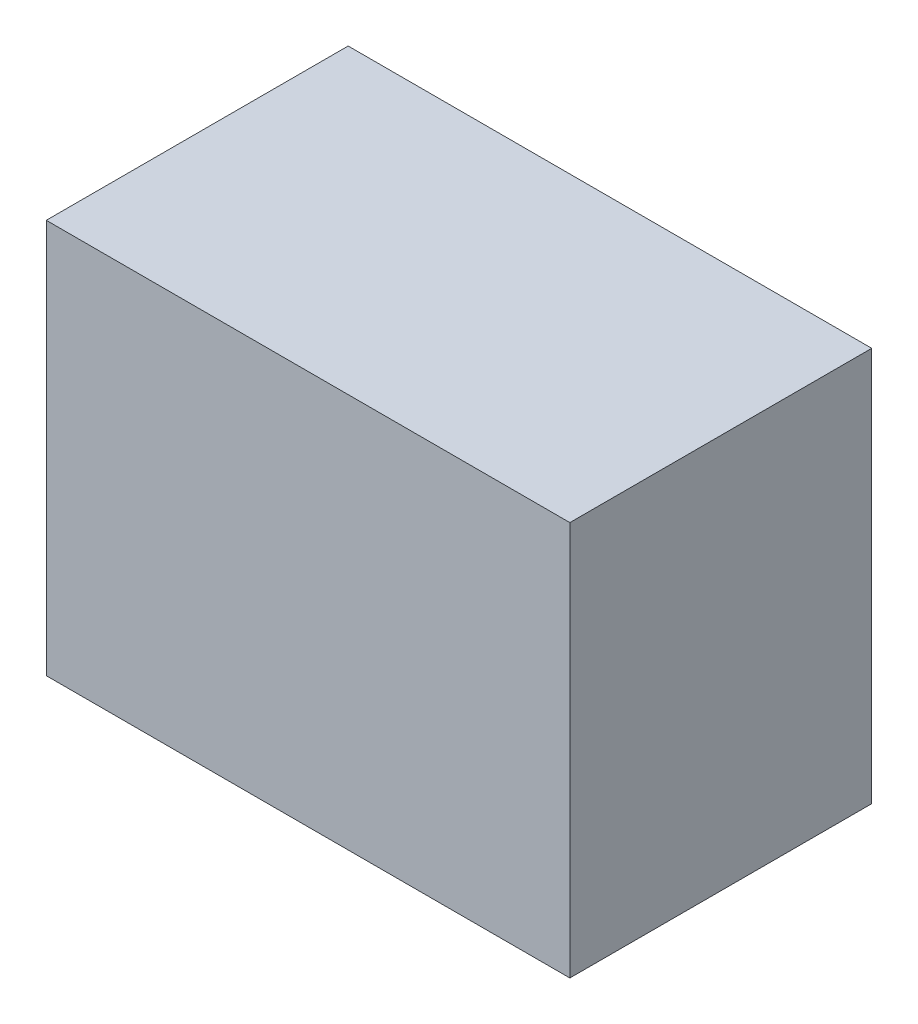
ISO-10303-21;
HEADER;
FILE_DESCRIPTION(('STEP AP214'),'2;1');
FILE_NAME('part.step','',(''),(''),'','','');
FILE_SCHEMA(('AUTOMOTIVE_DESIGN { 1 0 10303 214 1 1 1 1 }'));
ENDSEC;
DATA;
#1=APPLICATION_CONTEXT('core data for automotive mechanical design processes');
#2=APPLICATION_PROTOCOL_DEFINITION('international standard','automotive_design',2000,#1);
#3=PRODUCT_CONTEXT('',#1,'mechanical');
#4=PRODUCT('Part','Part','',(#3));
#5=PRODUCT_RELATED_PRODUCT_CATEGORY('part','',(#4));
#6=PRODUCT_DEFINITION_FORMATION('','',#4);
#7=PRODUCT_DEFINITION_CONTEXT('part definition',#1,'design');
#8=PRODUCT_DEFINITION('design','',#6,#7);
#9=PRODUCT_DEFINITION_SHAPE('','',#8);
#10=(LENGTH_UNIT() NAMED_UNIT(*) SI_UNIT(.MILLI.,.METRE.));
#11=(NAMED_UNIT(*) PLANE_ANGLE_UNIT() SI_UNIT($,.RADIAN.));
#12=(NAMED_UNIT(*) SI_UNIT($,.STERADIAN.) SOLID_ANGLE_UNIT());
#13=UNCERTAINTY_MEASURE_WITH_UNIT(LENGTH_MEASURE(1.E-05),#10,'distance_accuracy_value','');
#14=(GEOMETRIC_REPRESENTATION_CONTEXT(3) GLOBAL_UNCERTAINTY_ASSIGNED_CONTEXT((#13)) GLOBAL_UNIT_ASSIGNED_CONTEXT((#10,
#11,#12)) REPRESENTATION_CONTEXT('',''));
#15=CARTESIAN_POINT('',(0.,0.,0.));
#16=DIRECTION('',(0.,0.,1.));
#17=DIRECTION('',(1.,0.,0.));
#18=AXIS2_PLACEMENT_3D('',#15,#16,#17);
#19=CARTESIAN_POINT('',(0.,1.269999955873E-06,0.22999954));
#20=DIRECTION('',(0.,0.,1.));
#21=DIRECTION('',(1.,0.,0.));
#22=AXIS2_PLACEMENT_3D('',#19,#20,#21);
#23=PLANE('',#22);
#24=DIRECTION('',(1.,0.,0.));
#25=VECTOR('',#24,1.);
#26=CARTESIAN_POINT('',(-0.19945604,-0.150241,0.22999954));
#27=LINE('',#26,#25);
#28=CARTESIAN_POINT('',(-0.19945604,-0.150241,0.22999954));
#29=VERTEX_POINT('',#28);
#30=CARTESIAN_POINT('',(0.19945604,-0.150241,0.22999954));
#31=VERTEX_POINT('',#30);
#32=EDGE_CURVE('E84',#29,#31,#27,.T.);
#33=ORIENTED_EDGE('',*,*,#32,.T.);
#34=DIRECTION('',(0.,1.,0.));
#35=VECTOR('',#34,1.);
#36=CARTESIAN_POINT('',(0.19945604,-0.150241,0.22999954));
#37=LINE('',#36,#35);
#38=CARTESIAN_POINT('',(0.19945604,0.15024354,0.22999954));
#39=VERTEX_POINT('',#38);
#40=EDGE_CURVE('E108',#31,#39,#37,.T.);
#41=ORIENTED_EDGE('',*,*,#40,.T.);
#42=DIRECTION('',(-1.,0.,0.));
#43=VECTOR('',#42,1.);
#44=CARTESIAN_POINT('',(0.19945604,0.15024354,0.22999954));
#45=LINE('',#44,#43);
#46=CARTESIAN_POINT('',(-0.19945604,0.15024354,0.22999954));
#47=VERTEX_POINT('',#46);
#48=EDGE_CURVE('E76',#39,#47,#45,.T.);
#49=ORIENTED_EDGE('',*,*,#48,.T.);
#50=DIRECTION('',(0.,-1.,0.));
#51=VECTOR('',#50,1.);
#52=CARTESIAN_POINT('',(-0.19945604,0.15024354,0.22999954));
#53=LINE('',#52,#51);
#54=EDGE_CURVE('E11',#47,#29,#53,.T.);
#55=ORIENTED_EDGE('',*,*,#54,.T.);
#56=EDGE_LOOP('',(#33,#41,#49,#55));
#57=FACE_BOUND('',#56,.T.);
#58=ADVANCED_FACE('F17',(#57),#23,.T.);
#59=CARTESIAN_POINT('',(0.,1.269999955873E-06,0.));
#60=DIRECTION('',(0.,0.,1.));
#61=DIRECTION('',(1.,0.,0.));
#62=AXIS2_PLACEMENT_3D('',#59,#60,#61);
#63=PLANE('',#62);
#64=DIRECTION('',(0.,-1.,0.));
#65=VECTOR('',#64,1.);
#66=CARTESIAN_POINT('',(-0.19945604,0.15024354,0.));
#67=LINE('',#66,#65);
#68=CARTESIAN_POINT('',(-0.19945604,0.15024354,0.));
#69=VERTEX_POINT('',#68);
#70=CARTESIAN_POINT('',(-0.19945604,-0.150241,0.));
#71=VERTEX_POINT('',#70);
#72=EDGE_CURVE('E27',#69,#71,#67,.T.);
#73=ORIENTED_EDGE('',*,*,#72,.F.);
#74=DIRECTION('',(-1.,0.,0.));
#75=VECTOR('',#74,1.);
#76=CARTESIAN_POINT('',(0.19945604,0.15024354,0.));
#77=LINE('',#76,#75);
#78=CARTESIAN_POINT('',(0.19945604,0.15024354,0.));
#79=VERTEX_POINT('',#78);
#80=EDGE_CURVE('E111',#79,#69,#77,.T.);
#81=ORIENTED_EDGE('',*,*,#80,.F.);
#82=DIRECTION('',(0.,1.,0.));
#83=VECTOR('',#82,1.);
#84=CARTESIAN_POINT('',(0.19945604,-0.150241,0.));
#85=LINE('',#84,#83);
#86=CARTESIAN_POINT('',(0.19945604,-0.150241,0.));
#87=VERTEX_POINT('',#86);
#88=EDGE_CURVE('E86',#87,#79,#85,.T.);
#89=ORIENTED_EDGE('',*,*,#88,.F.);
#90=DIRECTION('',(1.,0.,0.));
#91=VECTOR('',#90,1.);
#92=CARTESIAN_POINT('',(-0.19945604,-0.150241,0.));
#93=LINE('',#92,#91);
#94=EDGE_CURVE('E82',#71,#87,#93,.T.);
#95=ORIENTED_EDGE('',*,*,#94,.F.);
#96=EDGE_LOOP('',(#73,#81,#89,#95));
#97=FACE_BOUND('',#96,.T.);
#98=ADVANCED_FACE('F19',(#97),#63,.F.);
#99=CARTESIAN_POINT('',(-0.19945604,0.15024354,0.));
#100=DIRECTION('',(1.,0.,0.));
#101=DIRECTION('',(0.,1.,0.));
#102=AXIS2_PLACEMENT_3D('',#99,#100,#101);
#103=PLANE('',#102);
#104=ORIENTED_EDGE('',*,*,#72,.T.);
#105=DIRECTION('',(0.,0.,1.));
#106=VECTOR('',#105,1.);
#107=CARTESIAN_POINT('',(-0.19945604,-0.150241,0.));
#108=LINE('',#107,#106);
#109=EDGE_CURVE('E71',#71,#29,#108,.T.);
#110=ORIENTED_EDGE('',*,*,#109,.T.);
#111=ORIENTED_EDGE('',*,*,#54,.F.);
#112=DIRECTION('',(0.,0.,1.));
#113=VECTOR('',#112,1.);
#114=CARTESIAN_POINT('',(-0.19945604,0.15024354,0.));
#115=LINE('',#114,#113);
#116=EDGE_CURVE('E21',#69,#47,#115,.T.);
#117=ORIENTED_EDGE('',*,*,#116,.F.);
#118=EDGE_LOOP('',(#104,#110,#111,#117));
#119=FACE_BOUND('',#118,.T.);
#120=ADVANCED_FACE('F70',(#119),#103,.F.);
#121=CARTESIAN_POINT('',(0.19945604,0.15024354,0.));
#122=DIRECTION('',(0.,-1.,0.));
#123=DIRECTION('',(0.,0.,-1.));
#124=AXIS2_PLACEMENT_3D('',#121,#122,#123);
#125=PLANE('',#124);
#126=ORIENTED_EDGE('',*,*,#80,.T.);
#127=ORIENTED_EDGE('',*,*,#116,.T.);
#128=ORIENTED_EDGE('',*,*,#48,.F.);
#129=DIRECTION('',(0.,0.,1.));
#130=VECTOR('',#129,1.);
#131=CARTESIAN_POINT('',(0.19945604,0.15024354,0.));
#132=LINE('',#131,#130);
#133=EDGE_CURVE('E104',#79,#39,#132,.T.);
#134=ORIENTED_EDGE('',*,*,#133,.F.);
#135=EDGE_LOOP('',(#126,#127,#128,#134));
#136=FACE_BOUND('',#135,.T.);
#137=ADVANCED_FACE('F124',(#136),#125,.F.);
#138=CARTESIAN_POINT('',(0.19945604,-0.150241,0.));
#139=DIRECTION('',(-1.,0.,0.));
#140=DIRECTION('',(0.,0.,1.));
#141=AXIS2_PLACEMENT_3D('',#138,#139,#140);
#142=PLANE('',#141);
#143=ORIENTED_EDGE('',*,*,#88,.T.);
#144=ORIENTED_EDGE('',*,*,#133,.T.);
#145=ORIENTED_EDGE('',*,*,#40,.F.);
#146=DIRECTION('',(0.,0.,1.));
#147=VECTOR('',#146,1.);
#148=CARTESIAN_POINT('',(0.19945604,-0.150241,0.));
#149=LINE('',#148,#147);
#150=EDGE_CURVE('E91',#87,#31,#149,.T.);
#151=ORIENTED_EDGE('',*,*,#150,.F.);
#152=EDGE_LOOP('',(#143,#144,#145,#151));
#153=FACE_BOUND('',#152,.T.);
#154=ADVANCED_FACE('F126',(#153),#142,.F.);
#155=CARTESIAN_POINT('',(-0.19945604,-0.150241,0.));
#156=DIRECTION('',(0.,1.,0.));
#157=DIRECTION('',(1.,0.,0.));
#158=AXIS2_PLACEMENT_3D('',#155,#156,#157);
#159=PLANE('',#158);
#160=ORIENTED_EDGE('',*,*,#94,.T.);
#161=ORIENTED_EDGE('',*,*,#150,.T.);
#162=ORIENTED_EDGE('',*,*,#32,.F.);
#163=ORIENTED_EDGE('',*,*,#109,.F.);
#164=EDGE_LOOP('',(#160,#161,#162,#163));
#165=FACE_BOUND('',#164,.T.);
#166=ADVANCED_FACE('F80',(#165),#159,.F.);
#167=CLOSED_SHELL('',(#58,#98,#120,#137,#154,#166));
#168=MANIFOLD_SOLID_BREP('B1',#167);
#169=ADVANCED_BREP_SHAPE_REPRESENTATION('',(#18,#168),#14);
#170=SHAPE_DEFINITION_REPRESENTATION(#9,#169);
ENDSEC;
END-ISO-10303-21;
